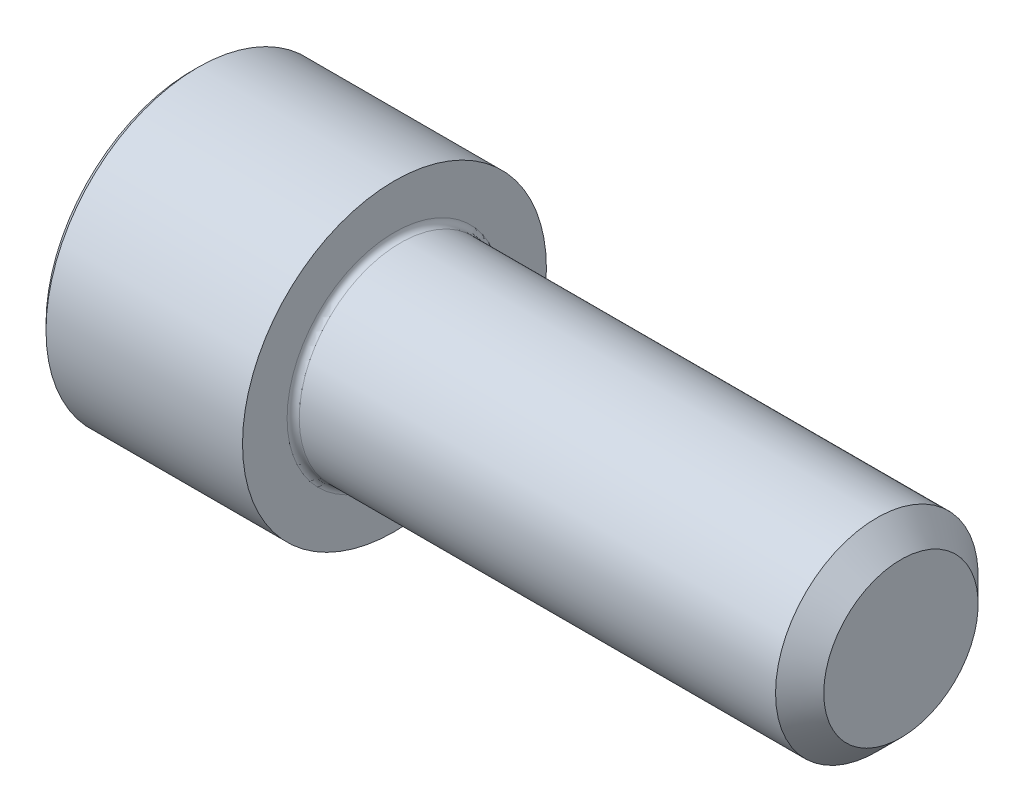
from build123d import *

# Parameters (mm, degrees)
CUT_EXTRUDE1_DEPTH = 3.048


with BuildPart() as part:
    # Sketch1 → Revolve1 (revolve)
    with BuildSketch(Plane.XY, mode=Mode.PRIVATE) as revolve1_sk:
        with BuildLine():
            Line((-6.35, 0), (-6.35, 4.572))
            Line((-6.35, 4.572), (-6.1595, 4.7625))
            Line((-6.1595, 4.7625), (0, 4.7625))
            Line((0, 4.7625), (0, 3.3655))
            ThreePointArc((0, 3.3655), (0.055796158, 3.230796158), (0.1905, 3.175))
            Line((0.1905, 3.175), (15.11935, 3.175))
            Line((15.11935, 3.175), (15.875, 2.41935))
            Line((15.875, 2.41935), (15.875, 0))
            Line((15.875, 0), (-6.35, 0))
        make_face()
    revolve(revolve1_sk.sketch.rotate(Axis((15.875, 0, 0), (-1, 0, 0)), 270), axis=Axis((15.875, 0, 0), (-1, 0, 0)))

    # Sketch2 → Cut-Extrude1 (cut)
    with BuildSketch(Plane(origin=(-6.35, 0, 0), x_dir=(0, 0, -1), z_dir=(1, 0, 0))):
        Polygon((-2.38125, 1.374815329), (-2.38125, -1.374815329), (0, -2.749630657), (2.38125, -1.374815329), (2.38125, 1.374815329), (0, 2.749630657), align=None)
    extrude(amount=CUT_EXTRUDE1_DEPTH, mode=Mode.SUBTRACT)

    # Sketch3 → Cut-Revolve1 (revolve, cut)
    with BuildSketch(Plane.XY, mode=Mode.PRIVATE) as cut_revolve1_sk:
        Polygon((-3.302, 0), (-3.302, 2.38125), (-1.927184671, 0), align=None)
    revolve(cut_revolve1_sk.sketch.rotate(Axis((-1.927184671, 0, 0), (-1, 0, 0)), 270), axis=Axis((-1.927184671, 0, 0), (-1, 0, 0)), mode=Mode.SUBTRACT)


solid = part.part
